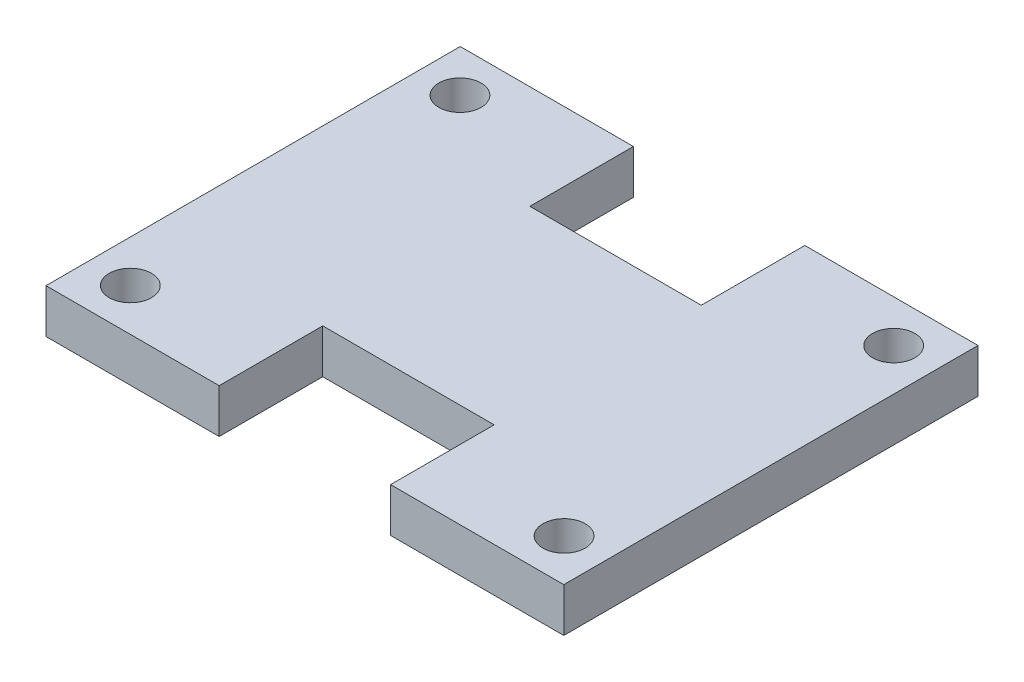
ISO-10303-21;
HEADER;
FILE_DESCRIPTION(('STEP AP214'),'2;1');
FILE_NAME('part.step','',(''),(''),'','','');
FILE_SCHEMA(('AUTOMOTIVE_DESIGN { 1 0 10303 214 1 1 1 1 }'));
ENDSEC;
DATA;
#1=APPLICATION_CONTEXT('core data for automotive mechanical design processes');
#2=APPLICATION_PROTOCOL_DEFINITION('international standard','automotive_design',2000,#1);
#3=PRODUCT_CONTEXT('',#1,'mechanical');
#4=PRODUCT('Part','Part','',(#3));
#5=PRODUCT_RELATED_PRODUCT_CATEGORY('part','',(#4));
#6=PRODUCT_DEFINITION_FORMATION('','',#4);
#7=PRODUCT_DEFINITION_CONTEXT('part definition',#1,'design');
#8=PRODUCT_DEFINITION('design','',#6,#7);
#9=PRODUCT_DEFINITION_SHAPE('','',#8);
#10=(LENGTH_UNIT() NAMED_UNIT(*) SI_UNIT(.MILLI.,.METRE.));
#11=(NAMED_UNIT(*) PLANE_ANGLE_UNIT() SI_UNIT($,.RADIAN.));
#12=(NAMED_UNIT(*) SI_UNIT($,.STERADIAN.) SOLID_ANGLE_UNIT());
#13=UNCERTAINTY_MEASURE_WITH_UNIT(LENGTH_MEASURE(1.E-05),#10,'distance_accuracy_value','');
#14=(GEOMETRIC_REPRESENTATION_CONTEXT(3) GLOBAL_UNCERTAINTY_ASSIGNED_CONTEXT((#13)) GLOBAL_UNIT_ASSIGNED_CONTEXT((#10,
#11,#12)) REPRESENTATION_CONTEXT('',''));
#15=CARTESIAN_POINT('',(0.,0.,0.));
#16=DIRECTION('',(0.,0.,1.));
#17=DIRECTION('',(1.,0.,0.));
#18=AXIS2_PLACEMENT_3D('',#15,#16,#17);
#19=CARTESIAN_POINT('',(4.94029999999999,2.54,11.938));
#20=DIRECTION('',(0.,0.,-1.));
#21=DIRECTION('',(-1.,0.,0.));
#22=AXIS2_PLACEMENT_3D('',#19,#20,#21);
#23=PLANE('',#22);
#24=DIRECTION('',(1.,0.,0.));
#25=VECTOR('',#24,1.);
#26=CARTESIAN_POINT('',(4.94029999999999,0.,11.938));
#27=LINE('',#26,#25);
#28=CARTESIAN_POINT('',(4.94029999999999,0.,11.938));
#29=VERTEX_POINT('',#28);
#30=CARTESIAN_POINT('',(14.9225,0.,11.938));
#31=VERTEX_POINT('',#30);
#32=EDGE_CURVE('E153',#29,#31,#27,.T.);
#33=ORIENTED_EDGE('',*,*,#32,.T.);
#34=DIRECTION('',(0.,-1.,0.));
#35=VECTOR('',#34,1.);
#36=CARTESIAN_POINT('',(14.9225,2.54,11.938));
#37=LINE('',#36,#35);
#38=CARTESIAN_POINT('',(14.9225,2.54,11.938));
#39=VERTEX_POINT('',#38);
#40=EDGE_CURVE('E11',#39,#31,#37,.T.);
#41=ORIENTED_EDGE('',*,*,#40,.F.);
#42=DIRECTION('',(1.,0.,0.));
#43=VECTOR('',#42,1.);
#44=CARTESIAN_POINT('',(4.94029999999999,2.54,11.938));
#45=LINE('',#44,#43);
#46=CARTESIAN_POINT('',(4.94029999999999,2.54,11.938));
#47=VERTEX_POINT('',#46);
#48=EDGE_CURVE('E176',#47,#39,#45,.T.);
#49=ORIENTED_EDGE('',*,*,#48,.F.);
#50=DIRECTION('',(0.,-1.,0.));
#51=VECTOR('',#50,1.);
#52=CARTESIAN_POINT('',(4.94029999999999,2.54,11.938));
#53=LINE('',#52,#51);
#54=EDGE_CURVE('E149',#47,#29,#53,.T.);
#55=ORIENTED_EDGE('',*,*,#54,.T.);
#56=EDGE_LOOP('',(#33,#41,#49,#55));
#57=FACE_BOUND('',#56,.T.);
#58=ADVANCED_FACE('F33',(#57),#23,.F.);
#59=CARTESIAN_POINT('',(14.9225,2.54,-11.938));
#60=DIRECTION('',(-1.,0.,0.));
#61=DIRECTION('',(0.,0.,1.));
#62=AXIS2_PLACEMENT_3D('',#59,#60,#61);
#63=PLANE('',#62);
#64=DIRECTION('',(0.,0.,-1.));
#65=VECTOR('',#64,1.);
#66=CARTESIAN_POINT('',(14.9225,0.,-11.938));
#67=LINE('',#66,#65);
#68=CARTESIAN_POINT('',(14.9225,0.,-11.938));
#69=VERTEX_POINT('',#68);
#70=EDGE_CURVE('E156',#31,#69,#67,.T.);
#71=ORIENTED_EDGE('',*,*,#70,.T.);
#72=DIRECTION('',(0.,-1.,0.));
#73=VECTOR('',#72,1.);
#74=CARTESIAN_POINT('',(14.9225,2.54,-11.938));
#75=LINE('',#74,#73);
#76=CARTESIAN_POINT('',(14.9225,2.54,-11.938));
#77=VERTEX_POINT('',#76);
#78=EDGE_CURVE('E41',#77,#69,#75,.T.);
#79=ORIENTED_EDGE('',*,*,#78,.F.);
#80=DIRECTION('',(0.,0.,-1.));
#81=VECTOR('',#80,1.);
#82=CARTESIAN_POINT('',(14.9225,2.54,-11.938));
#83=LINE('',#82,#81);
#84=EDGE_CURVE('E104',#39,#77,#83,.T.);
#85=ORIENTED_EDGE('',*,*,#84,.F.);
#86=ORIENTED_EDGE('',*,*,#40,.T.);
#87=EDGE_LOOP('',(#71,#79,#85,#86));
#88=FACE_BOUND('',#87,.T.);
#89=ADVANCED_FACE('F255',(#88),#63,.F.);
#90=CARTESIAN_POINT('',(4.94029999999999,2.54,-11.938));
#91=DIRECTION('',(0.,0.,1.));
#92=DIRECTION('',(1.,0.,0.));
#93=AXIS2_PLACEMENT_3D('',#90,#91,#92);
#94=PLANE('',#93);
#95=DIRECTION('',(-1.,0.,0.));
#96=VECTOR('',#95,1.);
#97=CARTESIAN_POINT('',(4.94029999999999,0.,-11.938));
#98=LINE('',#97,#96);
#99=CARTESIAN_POINT('',(4.94029999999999,0.,-11.938));
#100=VERTEX_POINT('',#99);
#101=EDGE_CURVE('E159',#69,#100,#98,.T.);
#102=ORIENTED_EDGE('',*,*,#101,.T.);
#103=DIRECTION('',(0.,-1.,0.));
#104=VECTOR('',#103,1.);
#105=CARTESIAN_POINT('',(4.94029999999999,2.54,-11.938));
#106=LINE('',#105,#104);
#107=CARTESIAN_POINT('',(4.94029999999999,2.54,-11.938));
#108=VERTEX_POINT('',#107);
#109=EDGE_CURVE('E195',#108,#100,#106,.T.);
#110=ORIENTED_EDGE('',*,*,#109,.F.);
#111=DIRECTION('',(-1.,0.,0.));
#112=VECTOR('',#111,1.);
#113=CARTESIAN_POINT('',(4.94029999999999,2.54,-11.938));
#114=LINE('',#113,#112);
#115=EDGE_CURVE('E203',#77,#108,#114,.T.);
#116=ORIENTED_EDGE('',*,*,#115,.F.);
#117=ORIENTED_EDGE('',*,*,#78,.T.);
#118=EDGE_LOOP('',(#102,#110,#116,#117));
#119=FACE_BOUND('',#118,.T.);
#120=ADVANCED_FACE('F201',(#119),#94,.F.);
#121=CARTESIAN_POINT('',(4.94029999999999,2.54,-11.938));
#122=DIRECTION('',(1.,0.,0.));
#123=DIRECTION('',(0.,0.,-1.));
#124=AXIS2_PLACEMENT_3D('',#121,#122,#123);
#125=PLANE('',#124);
#126=DIRECTION('',(0.,0.,1.));
#127=VECTOR('',#126,1.);
#128=CARTESIAN_POINT('',(4.94029999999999,0.,-11.938));
#129=LINE('',#128,#127);
#130=CARTESIAN_POINT('',(4.94029999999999,0.,-5.969));
#131=VERTEX_POINT('',#130);
#132=EDGE_CURVE('E161',#100,#131,#129,.T.);
#133=ORIENTED_EDGE('',*,*,#132,.T.);
#134=DIRECTION('',(0.,-1.,0.));
#135=VECTOR('',#134,1.);
#136=CARTESIAN_POINT('',(4.94029999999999,2.54,-5.969));
#137=LINE('',#136,#135);
#138=CARTESIAN_POINT('',(4.94029999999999,2.54,-5.969));
#139=VERTEX_POINT('',#138);
#140=EDGE_CURVE('E192',#139,#131,#137,.T.);
#141=ORIENTED_EDGE('',*,*,#140,.F.);
#142=DIRECTION('',(0.,0.,1.));
#143=VECTOR('',#142,1.);
#144=CARTESIAN_POINT('',(4.94029999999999,2.54,-11.938));
#145=LINE('',#144,#143);
#146=EDGE_CURVE('E221',#108,#139,#145,.T.);
#147=ORIENTED_EDGE('',*,*,#146,.F.);
#148=ORIENTED_EDGE('',*,*,#109,.T.);
#149=EDGE_LOOP('',(#133,#141,#147,#148));
#150=FACE_BOUND('',#149,.T.);
#151=ADVANCED_FACE('F212',(#150),#125,.F.);
#152=CARTESIAN_POINT('',(-4.9403,2.54,-5.969));
#153=DIRECTION('',(0.,0.,1.));
#154=DIRECTION('',(1.,0.,0.));
#155=AXIS2_PLACEMENT_3D('',#152,#153,#154);
#156=PLANE('',#155);
#157=DIRECTION('',(-1.,0.,0.));
#158=VECTOR('',#157,1.);
#159=CARTESIAN_POINT('',(-4.9403,0.,-5.969));
#160=LINE('',#159,#158);
#161=CARTESIAN_POINT('',(-4.9403,0.,-5.969));
#162=VERTEX_POINT('',#161);
#163=EDGE_CURVE('E163',#131,#162,#160,.T.);
#164=ORIENTED_EDGE('',*,*,#163,.T.);
#165=DIRECTION('',(0.,-1.,0.));
#166=VECTOR('',#165,1.);
#167=CARTESIAN_POINT('',(-4.9403,2.54,-5.969));
#168=LINE('',#167,#166);
#169=CARTESIAN_POINT('',(-4.9403,2.54,-5.969));
#170=VERTEX_POINT('',#169);
#171=EDGE_CURVE('E189',#170,#162,#168,.T.);
#172=ORIENTED_EDGE('',*,*,#171,.F.);
#173=DIRECTION('',(-1.,0.,0.));
#174=VECTOR('',#173,1.);
#175=CARTESIAN_POINT('',(-4.9403,2.54,-5.969));
#176=LINE('',#175,#174);
#177=EDGE_CURVE('E218',#139,#170,#176,.T.);
#178=ORIENTED_EDGE('',*,*,#177,.F.);
#179=ORIENTED_EDGE('',*,*,#140,.T.);
#180=EDGE_LOOP('',(#164,#172,#178,#179));
#181=FACE_BOUND('',#180,.T.);
#182=ADVANCED_FACE('F216',(#181),#156,.F.);
#183=CARTESIAN_POINT('',(-4.9403,2.54,-11.938));
#184=DIRECTION('',(-1.,0.,0.));
#185=DIRECTION('',(0.,0.,1.));
#186=AXIS2_PLACEMENT_3D('',#183,#184,#185);
#187=PLANE('',#186);
#188=DIRECTION('',(0.,0.,-1.));
#189=VECTOR('',#188,1.);
#190=CARTESIAN_POINT('',(-4.9403,0.,-11.938));
#191=LINE('',#190,#189);
#192=CARTESIAN_POINT('',(-4.9403,0.,-11.938));
#193=VERTEX_POINT('',#192);
#194=EDGE_CURVE('E165',#162,#193,#191,.T.);
#195=ORIENTED_EDGE('',*,*,#194,.T.);
#196=DIRECTION('',(0.,-1.,0.));
#197=VECTOR('',#196,1.);
#198=CARTESIAN_POINT('',(-4.9403,2.54,-11.938));
#199=LINE('',#198,#197);
#200=CARTESIAN_POINT('',(-4.9403,2.54,-11.938));
#201=VERTEX_POINT('',#200);
#202=EDGE_CURVE('E186',#201,#193,#199,.T.);
#203=ORIENTED_EDGE('',*,*,#202,.F.);
#204=DIRECTION('',(0.,0.,-1.));
#205=VECTOR('',#204,1.);
#206=CARTESIAN_POINT('',(-4.9403,2.54,-11.938));
#207=LINE('',#206,#205);
#208=EDGE_CURVE('E220',#170,#201,#207,.T.);
#209=ORIENTED_EDGE('',*,*,#208,.F.);
#210=ORIENTED_EDGE('',*,*,#171,.T.);
#211=EDGE_LOOP('',(#195,#203,#209,#210));
#212=FACE_BOUND('',#211,.T.);
#213=ADVANCED_FACE('F268',(#212),#187,.F.);
#214=CARTESIAN_POINT('',(-14.9225,2.54,-11.938));
#215=DIRECTION('',(0.,0.,1.));
#216=DIRECTION('',(1.,0.,0.));
#217=AXIS2_PLACEMENT_3D('',#214,#215,#216);
#218=PLANE('',#217);
#219=DIRECTION('',(-1.,0.,0.));
#220=VECTOR('',#219,1.);
#221=CARTESIAN_POINT('',(-14.9225,0.,-11.938));
#222=LINE('',#221,#220);
#223=CARTESIAN_POINT('',(-14.9225,0.,-11.938));
#224=VERTEX_POINT('',#223);
#225=EDGE_CURVE('E167',#193,#224,#222,.T.);
#226=ORIENTED_EDGE('',*,*,#225,.T.);
#227=DIRECTION('',(0.,-1.,0.));
#228=VECTOR('',#227,1.);
#229=CARTESIAN_POINT('',(-14.9225,2.54,-11.938));
#230=LINE('',#229,#228);
#231=CARTESIAN_POINT('',(-14.9225,2.54,-11.938));
#232=VERTEX_POINT('',#231);
#233=EDGE_CURVE('E183',#232,#224,#230,.T.);
#234=ORIENTED_EDGE('',*,*,#233,.F.);
#235=DIRECTION('',(-1.,0.,0.));
#236=VECTOR('',#235,1.);
#237=CARTESIAN_POINT('',(-14.9225,2.54,-11.938));
#238=LINE('',#237,#236);
#239=EDGE_CURVE('E223',#201,#232,#238,.T.);
#240=ORIENTED_EDGE('',*,*,#239,.F.);
#241=ORIENTED_EDGE('',*,*,#202,.T.);
#242=EDGE_LOOP('',(#226,#234,#240,#241));
#243=FACE_BOUND('',#242,.T.);
#244=ADVANCED_FACE('F271',(#243),#218,.F.);
#245=CARTESIAN_POINT('',(-14.9225,2.54,-11.938));
#246=DIRECTION('',(1.,0.,0.));
#247=DIRECTION('',(0.,0.,-1.));
#248=AXIS2_PLACEMENT_3D('',#245,#246,#247);
#249=PLANE('',#248);
#250=DIRECTION('',(0.,0.,1.));
#251=VECTOR('',#250,1.);
#252=CARTESIAN_POINT('',(-14.9225,0.,-11.938));
#253=LINE('',#252,#251);
#254=CARTESIAN_POINT('',(-14.9225,0.,11.938));
#255=VERTEX_POINT('',#254);
#256=EDGE_CURVE('E169',#224,#255,#253,.T.);
#257=ORIENTED_EDGE('',*,*,#256,.T.);
#258=DIRECTION('',(0.,-1.,0.));
#259=VECTOR('',#258,1.);
#260=CARTESIAN_POINT('',(-14.9225,2.54,11.938));
#261=LINE('',#260,#259);
#262=CARTESIAN_POINT('',(-14.9225,2.54,11.938));
#263=VERTEX_POINT('',#262);
#264=EDGE_CURVE('E180',#263,#255,#261,.T.);
#265=ORIENTED_EDGE('',*,*,#264,.F.);
#266=DIRECTION('',(0.,0.,1.));
#267=VECTOR('',#266,1.);
#268=CARTESIAN_POINT('',(-14.9225,2.54,-11.938));
#269=LINE('',#268,#267);
#270=EDGE_CURVE('E229',#232,#263,#269,.T.);
#271=ORIENTED_EDGE('',*,*,#270,.F.);
#272=ORIENTED_EDGE('',*,*,#233,.T.);
#273=EDGE_LOOP('',(#257,#265,#271,#272));
#274=FACE_BOUND('',#273,.T.);
#275=ADVANCED_FACE('F235',(#274),#249,.F.);
#276=CARTESIAN_POINT('',(-14.9225,2.54,11.938));
#277=DIRECTION('',(0.,0.,-1.));
#278=DIRECTION('',(-1.,0.,0.));
#279=AXIS2_PLACEMENT_3D('',#276,#277,#278);
#280=PLANE('',#279);
#281=DIRECTION('',(1.,0.,0.));
#282=VECTOR('',#281,1.);
#283=CARTESIAN_POINT('',(-14.9225,0.,11.938));
#284=LINE('',#283,#282);
#285=CARTESIAN_POINT('',(-4.9403,0.,11.938));
#286=VERTEX_POINT('',#285);
#287=EDGE_CURVE('E171',#255,#286,#284,.T.);
#288=ORIENTED_EDGE('',*,*,#287,.T.);
#289=DIRECTION('',(0.,-1.,0.));
#290=VECTOR('',#289,1.);
#291=CARTESIAN_POINT('',(-4.9403,2.54,11.938));
#292=LINE('',#291,#290);
#293=CARTESIAN_POINT('',(-4.9403,2.54,11.938));
#294=VERTEX_POINT('',#293);
#295=EDGE_CURVE('E144',#294,#286,#292,.T.);
#296=ORIENTED_EDGE('',*,*,#295,.F.);
#297=DIRECTION('',(1.,0.,0.));
#298=VECTOR('',#297,1.);
#299=CARTESIAN_POINT('',(-14.9225,2.54,11.938));
#300=LINE('',#299,#298);
#301=EDGE_CURVE('E135',#263,#294,#300,.T.);
#302=ORIENTED_EDGE('',*,*,#301,.F.);
#303=ORIENTED_EDGE('',*,*,#264,.T.);
#304=EDGE_LOOP('',(#288,#296,#302,#303));
#305=FACE_BOUND('',#304,.T.);
#306=ADVANCED_FACE('F239',(#305),#280,.F.);
#307=CARTESIAN_POINT('',(-4.9403,2.54,11.938));
#308=DIRECTION('',(-1.,0.,0.));
#309=DIRECTION('',(0.,0.,1.));
#310=AXIS2_PLACEMENT_3D('',#307,#308,#309);
#311=PLANE('',#310);
#312=DIRECTION('',(0.,0.,-1.));
#313=VECTOR('',#312,1.);
#314=CARTESIAN_POINT('',(-4.9403,0.,11.938));
#315=LINE('',#314,#313);
#316=CARTESIAN_POINT('',(-4.9403,0.,5.969));
#317=VERTEX_POINT('',#316);
#318=EDGE_CURVE('E143',#286,#317,#315,.T.);
#319=ORIENTED_EDGE('',*,*,#318,.T.);
#320=DIRECTION('',(0.,-1.,0.));
#321=VECTOR('',#320,1.);
#322=CARTESIAN_POINT('',(-4.9403,2.54,5.969));
#323=LINE('',#322,#321);
#324=CARTESIAN_POINT('',(-4.9403,2.54,5.969));
#325=VERTEX_POINT('',#324);
#326=EDGE_CURVE('E140',#325,#317,#323,.T.);
#327=ORIENTED_EDGE('',*,*,#326,.F.);
#328=DIRECTION('',(0.,0.,-1.));
#329=VECTOR('',#328,1.);
#330=CARTESIAN_POINT('',(-4.9403,2.54,11.938));
#331=LINE('',#330,#329);
#332=EDGE_CURVE('E129',#294,#325,#331,.T.);
#333=ORIENTED_EDGE('',*,*,#332,.F.);
#334=ORIENTED_EDGE('',*,*,#295,.T.);
#335=EDGE_LOOP('',(#319,#327,#333,#334));
#336=FACE_BOUND('',#335,.T.);
#337=ADVANCED_FACE('F141',(#336),#311,.F.);
#338=CARTESIAN_POINT('',(-4.9403,2.54,5.969));
#339=DIRECTION('',(0.,0.,-1.));
#340=DIRECTION('',(-1.,0.,0.));
#341=AXIS2_PLACEMENT_3D('',#338,#339,#340);
#342=PLANE('',#341);
#343=DIRECTION('',(1.,0.,0.));
#344=VECTOR('',#343,1.);
#345=CARTESIAN_POINT('',(-4.9403,0.,5.969));
#346=LINE('',#345,#344);
#347=CARTESIAN_POINT('',(4.94029999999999,0.,5.969));
#348=VERTEX_POINT('',#347);
#349=EDGE_CURVE('E90',#317,#348,#346,.T.);
#350=ORIENTED_EDGE('',*,*,#349,.T.);
#351=DIRECTION('',(0.,-1.,0.));
#352=VECTOR('',#351,1.);
#353=CARTESIAN_POINT('',(4.94029999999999,2.54,5.969));
#354=LINE('',#353,#352);
#355=CARTESIAN_POINT('',(4.94029999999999,2.54,5.969));
#356=VERTEX_POINT('',#355);
#357=EDGE_CURVE('E145',#356,#348,#354,.T.);
#358=ORIENTED_EDGE('',*,*,#357,.F.);
#359=DIRECTION('',(1.,0.,0.));
#360=VECTOR('',#359,1.);
#361=CARTESIAN_POINT('',(-4.9403,2.54,5.969));
#362=LINE('',#361,#360);
#363=EDGE_CURVE('E133',#325,#356,#362,.T.);
#364=ORIENTED_EDGE('',*,*,#363,.F.);
#365=ORIENTED_EDGE('',*,*,#326,.T.);
#366=EDGE_LOOP('',(#350,#358,#364,#365));
#367=FACE_BOUND('',#366,.T.);
#368=ADVANCED_FACE('F147',(#367),#342,.F.);
#369=CARTESIAN_POINT('',(4.94029999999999,2.54,11.938));
#370=DIRECTION('',(1.,0.,0.));
#371=DIRECTION('',(0.,0.,-1.));
#372=AXIS2_PLACEMENT_3D('',#369,#370,#371);
#373=PLANE('',#372);
#374=DIRECTION('',(0.,0.,1.));
#375=VECTOR('',#374,1.);
#376=CARTESIAN_POINT('',(4.94029999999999,0.,11.938));
#377=LINE('',#376,#375);
#378=EDGE_CURVE('E96',#348,#29,#377,.T.);
#379=ORIENTED_EDGE('',*,*,#378,.T.);
#380=ORIENTED_EDGE('',*,*,#54,.F.);
#381=DIRECTION('',(0.,0.,1.));
#382=VECTOR('',#381,1.);
#383=CARTESIAN_POINT('',(4.94029999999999,2.54,11.938));
#384=LINE('',#383,#382);
#385=EDGE_CURVE('E49',#356,#47,#384,.T.);
#386=ORIENTED_EDGE('',*,*,#385,.F.);
#387=ORIENTED_EDGE('',*,*,#357,.T.);
#388=EDGE_LOOP('',(#379,#380,#386,#387));
#389=FACE_BOUND('',#388,.T.);
#390=ADVANCED_FACE('F243',(#389),#373,.F.);
#391=CARTESIAN_POINT('',(0.,2.54,0.));
#392=DIRECTION('',(0.,-1.,0.));
#393=DIRECTION('',(0.,0.,-1.));
#394=AXIS2_PLACEMENT_3D('',#391,#392,#393);
#395=PLANE('',#394);
#396=CARTESIAN_POINT('',(-12.5,2.54,-9.4996));
#397=DIRECTION('',(0.,1.,0.));
#398=DIRECTION('',(0.,0.,1.));
#399=AXIS2_PLACEMENT_3D('',#396,#397,#398);
#400=CIRCLE('',#399,1.2192);
#401=CARTESIAN_POINT('',(-12.5,2.54,-8.2804));
#402=VERTEX_POINT('',#401);
#403=EDGE_CURVE('E357',#402,#402,#400,.T.);
#404=ORIENTED_EDGE('',*,*,#403,.F.);
#405=EDGE_LOOP('',(#404));
#406=FACE_BOUND('',#405,.T.);
#407=CARTESIAN_POINT('',(12.5,2.54,-9.4996));
#408=DIRECTION('',(0.,1.,0.));
#409=DIRECTION('',(0.,0.,1.));
#410=AXIS2_PLACEMENT_3D('',#407,#408,#409);
#411=CIRCLE('',#410,1.2192);
#412=CARTESIAN_POINT('',(12.5,2.54,-8.2804));
#413=VERTEX_POINT('',#412);
#414=EDGE_CURVE('E359',#413,#413,#411,.T.);
#415=ORIENTED_EDGE('',*,*,#414,.F.);
#416=EDGE_LOOP('',(#415));
#417=FACE_BOUND('',#416,.T.);
#418=CARTESIAN_POINT('',(12.5,2.54,9.4996));
#419=DIRECTION('',(0.,1.,0.));
#420=DIRECTION('',(0.,0.,1.));
#421=AXIS2_PLACEMENT_3D('',#418,#419,#420);
#422=CIRCLE('',#421,1.2192);
#423=CARTESIAN_POINT('',(12.5,2.54,10.7188));
#424=VERTEX_POINT('',#423);
#425=EDGE_CURVE('E367',#424,#424,#422,.T.);
#426=ORIENTED_EDGE('',*,*,#425,.F.);
#427=EDGE_LOOP('',(#426));
#428=FACE_BOUND('',#427,.T.);
#429=CARTESIAN_POINT('',(-12.5,2.54,9.4996));
#430=DIRECTION('',(0.,1.,0.));
#431=DIRECTION('',(0.,0.,1.));
#432=AXIS2_PLACEMENT_3D('',#429,#430,#431);
#433=CIRCLE('',#432,1.2192);
#434=CARTESIAN_POINT('',(-12.5,2.54,10.7188));
#435=VERTEX_POINT('',#434);
#436=EDGE_CURVE('E373',#435,#435,#433,.T.);
#437=ORIENTED_EDGE('',*,*,#436,.F.);
#438=EDGE_LOOP('',(#437));
#439=FACE_BOUND('',#438,.T.);
#440=ORIENTED_EDGE('',*,*,#48,.T.);
#441=ORIENTED_EDGE('',*,*,#84,.T.);
#442=ORIENTED_EDGE('',*,*,#115,.T.);
#443=ORIENTED_EDGE('',*,*,#146,.T.);
#444=ORIENTED_EDGE('',*,*,#177,.T.);
#445=ORIENTED_EDGE('',*,*,#208,.T.);
#446=ORIENTED_EDGE('',*,*,#239,.T.);
#447=ORIENTED_EDGE('',*,*,#270,.T.);
#448=ORIENTED_EDGE('',*,*,#301,.T.);
#449=ORIENTED_EDGE('',*,*,#332,.T.);
#450=ORIENTED_EDGE('',*,*,#363,.T.);
#451=ORIENTED_EDGE('',*,*,#385,.T.);
#452=EDGE_LOOP('',(#440,#441,#442,#443,#444,#445,#446,#447,#448,#449,#450,#451));
#453=FACE_BOUND('',#452,.T.);
#454=ADVANCED_FACE('F131',(#406,#417,#428,#439,#453),#395,.F.);
#455=CARTESIAN_POINT('',(0.,0.,0.));
#456=DIRECTION('',(0.,-1.,0.));
#457=DIRECTION('',(0.,0.,-1.));
#458=AXIS2_PLACEMENT_3D('',#455,#456,#457);
#459=PLANE('',#458);
#460=CARTESIAN_POINT('',(-12.5,0.,-9.4996));
#461=DIRECTION('',(0.,1.,0.));
#462=DIRECTION('',(0.,0.,1.));
#463=AXIS2_PLACEMENT_3D('',#460,#461,#462);
#464=CIRCLE('',#463,1.2192);
#465=CARTESIAN_POINT('',(-12.5,0.,-8.2804));
#466=VERTEX_POINT('',#465);
#467=EDGE_CURVE('E354',#466,#466,#464,.T.);
#468=ORIENTED_EDGE('',*,*,#467,.T.);
#469=EDGE_LOOP('',(#468));
#470=FACE_BOUND('',#469,.T.);
#471=CARTESIAN_POINT('',(12.5,0.,-9.4996));
#472=DIRECTION('',(0.,1.,0.));
#473=DIRECTION('',(0.,0.,1.));
#474=AXIS2_PLACEMENT_3D('',#471,#472,#473);
#475=CIRCLE('',#474,1.2192);
#476=CARTESIAN_POINT('',(12.5,0.,-8.2804));
#477=VERTEX_POINT('',#476);
#478=EDGE_CURVE('E364',#477,#477,#475,.T.);
#479=ORIENTED_EDGE('',*,*,#478,.T.);
#480=EDGE_LOOP('',(#479));
#481=FACE_BOUND('',#480,.T.);
#482=CARTESIAN_POINT('',(12.5,0.,9.4996));
#483=DIRECTION('',(0.,1.,0.));
#484=DIRECTION('',(0.,0.,1.));
#485=AXIS2_PLACEMENT_3D('',#482,#483,#484);
#486=CIRCLE('',#485,1.2192);
#487=CARTESIAN_POINT('',(12.5,0.,10.7188));
#488=VERTEX_POINT('',#487);
#489=EDGE_CURVE('E370',#488,#488,#486,.T.);
#490=ORIENTED_EDGE('',*,*,#489,.T.);
#491=EDGE_LOOP('',(#490));
#492=FACE_BOUND('',#491,.T.);
#493=CARTESIAN_POINT('',(-12.5,0.,9.4996));
#494=DIRECTION('',(0.,1.,0.));
#495=DIRECTION('',(0.,0.,1.));
#496=AXIS2_PLACEMENT_3D('',#493,#494,#495);
#497=CIRCLE('',#496,1.2192);
#498=CARTESIAN_POINT('',(-12.5,0.,10.7188));
#499=VERTEX_POINT('',#498);
#500=EDGE_CURVE('E157',#499,#499,#497,.T.);
#501=ORIENTED_EDGE('',*,*,#500,.T.);
#502=EDGE_LOOP('',(#501));
#503=FACE_BOUND('',#502,.T.);
#504=ORIENTED_EDGE('',*,*,#32,.F.);
#505=ORIENTED_EDGE('',*,*,#378,.F.);
#506=ORIENTED_EDGE('',*,*,#349,.F.);
#507=ORIENTED_EDGE('',*,*,#318,.F.);
#508=ORIENTED_EDGE('',*,*,#287,.F.);
#509=ORIENTED_EDGE('',*,*,#256,.F.);
#510=ORIENTED_EDGE('',*,*,#225,.F.);
#511=ORIENTED_EDGE('',*,*,#194,.F.);
#512=ORIENTED_EDGE('',*,*,#163,.F.);
#513=ORIENTED_EDGE('',*,*,#132,.F.);
#514=ORIENTED_EDGE('',*,*,#101,.F.);
#515=ORIENTED_EDGE('',*,*,#70,.F.);
#516=EDGE_LOOP('',(#504,#505,#506,#507,#508,#509,#510,#511,#512,#513,#514,#515));
#517=FACE_BOUND('',#516,.T.);
#518=ADVANCED_FACE('F207',(#470,#481,#492,#503,#517),#459,.T.);
#519=CARTESIAN_POINT('',(-12.5,2.54,9.4996));
#520=DIRECTION('',(0.,1.,0.));
#521=DIRECTION('',(0.,0.,1.));
#522=AXIS2_PLACEMENT_3D('',#519,#520,#521);
#523=CYLINDRICAL_SURFACE('',#522,1.2192);
#524=ORIENTED_EDGE('',*,*,#500,.F.);
#525=EDGE_LOOP('',(#524));
#526=FACE_BOUND('',#525,.T.);
#527=ORIENTED_EDGE('',*,*,#436,.T.);
#528=EDGE_LOOP('',(#527));
#529=FACE_BOUND('',#528,.T.);
#530=ADVANCED_FACE('F308',(#526,#529),#523,.F.);
#531=CARTESIAN_POINT('',(12.5,2.54,9.4996));
#532=DIRECTION('',(0.,1.,0.));
#533=DIRECTION('',(0.,0.,1.));
#534=AXIS2_PLACEMENT_3D('',#531,#532,#533);
#535=CYLINDRICAL_SURFACE('',#534,1.2192);
#536=ORIENTED_EDGE('',*,*,#489,.F.);
#537=EDGE_LOOP('',(#536));
#538=FACE_BOUND('',#537,.T.);
#539=ORIENTED_EDGE('',*,*,#425,.T.);
#540=EDGE_LOOP('',(#539));
#541=FACE_BOUND('',#540,.T.);
#542=ADVANCED_FACE('F317',(#538,#541),#535,.F.);
#543=CARTESIAN_POINT('',(12.5,2.54,-9.4996));
#544=DIRECTION('',(0.,1.,0.));
#545=DIRECTION('',(0.,0.,1.));
#546=AXIS2_PLACEMENT_3D('',#543,#544,#545);
#547=CYLINDRICAL_SURFACE('',#546,1.2192);
#548=ORIENTED_EDGE('',*,*,#478,.F.);
#549=EDGE_LOOP('',(#548));
#550=FACE_BOUND('',#549,.T.);
#551=ORIENTED_EDGE('',*,*,#414,.T.);
#552=EDGE_LOOP('',(#551));
#553=FACE_BOUND('',#552,.T.);
#554=ADVANCED_FACE('F327',(#550,#553),#547,.F.);
#555=CARTESIAN_POINT('',(-12.5,2.54,-9.4996));
#556=DIRECTION('',(0.,1.,0.));
#557=DIRECTION('',(0.,0.,1.));
#558=AXIS2_PLACEMENT_3D('',#555,#556,#557);
#559=CYLINDRICAL_SURFACE('',#558,1.2192);
#560=ORIENTED_EDGE('',*,*,#467,.F.);
#561=EDGE_LOOP('',(#560));
#562=FACE_BOUND('',#561,.T.);
#563=ORIENTED_EDGE('',*,*,#403,.T.);
#564=EDGE_LOOP('',(#563));
#565=FACE_BOUND('',#564,.T.);
#566=ADVANCED_FACE('F337',(#562,#565),#559,.F.);
#567=CLOSED_SHELL('',(#58,#89,#120,#151,#182,#213,#244,#275,#306,#337,#368,#390,#454,#518,#530,
#542,#554,#566));
#568=MANIFOLD_SOLID_BREP('B2',#567);
#569=ADVANCED_BREP_SHAPE_REPRESENTATION('',(#18,#568),#14);
#570=SHAPE_DEFINITION_REPRESENTATION(#9,#569);
ENDSEC;
END-ISO-10303-21;
